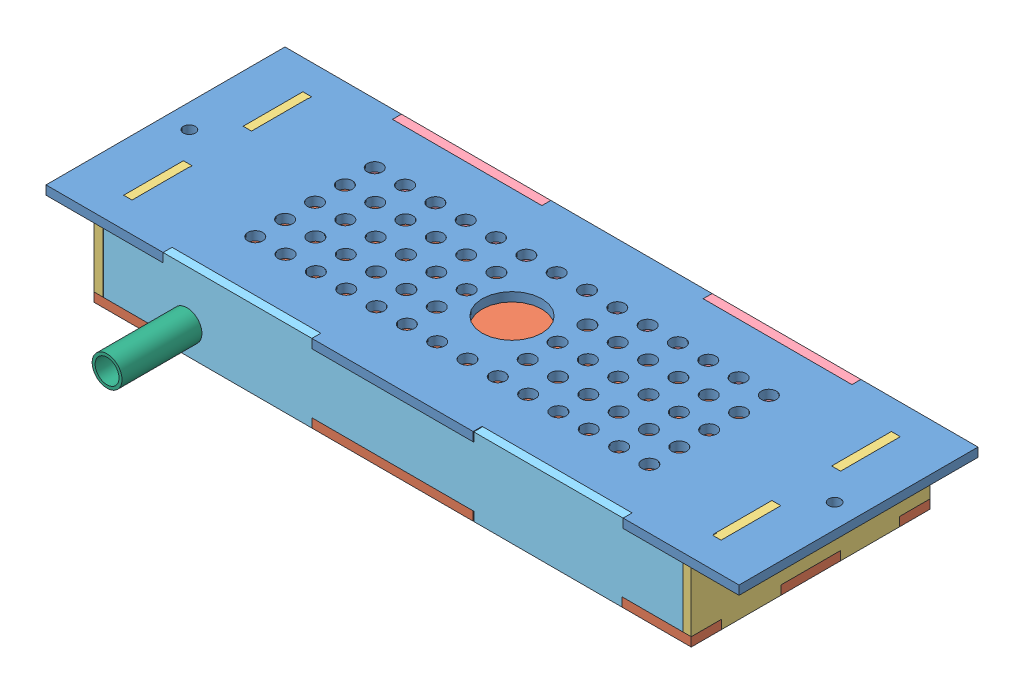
SolidWorks assembly stand.SLDASM, configuration Default (file format 9000). Lengths in mm.
Overall size (232 26 106.75).
7 component instances, 6 part files, 17 mates.
Components (placement in the parent):
- dispenser_stand-1: dispenser_stand.SLDPRT [Default] at (-170.7312 77.8011 232.5883) size (232 3 80)
- dispenser_stand.p2-1: dispenser_stand.p2.SLDPRT [Default] at (-154.7312 54.8011 232.5883) size (200 3 80)
- dispenser_stand.p3-1: dispenser_stand.p3.SLDPRT [Default] at (-154.7312 54.8011 312.5883) x (0 0 -1) z (1 0 0) size (80 26 3)
- dispenser_stand.p3-2: dispenser_stand.p3.SLDPRT [Default] at (42.2688 54.8011 312.5883) x (0 0 -1) z (1 0 0) size (80 26 3)
- dispenser_stand.p4-2: dispenser_stand.p4.SLDPRT [Default] at (-151.7312 54.8011 232.5883) size (194 26 3)
- dispenser_stand.p5-2: dispenser_stand.p5.SLDPRT [Default] at (42.4688 54.8011 312.5883) x (-1 0 0) z (0 0 -1) size (194 26 3)
- cylinder_dispenser-1: cylinder_dispenser.SLDPRT [Default] at (-123.5312 60.8011 309.3379) x (0.97573 0.218977 0) z (0 0 1) size (10 10 30)
Mates (geometry in assembly coordinates):
- Coincident7: coincident aligned: plane of dispenser_stand-1 through (-170.7312 77.8011 312.5883) normal (0 1 0); plane of dispenser_stand.p3-1 through (-151.7312 77.8011 242.5883) normal (0 1 0)
- Coincident8: coincident anti-aligned: plane of dispenser_stand-1 through (-154.7312 67.8011 242.5883) normal (1 0 0); plane of dispenser_stand.p3-1 through (-154.7312 54.8011 312.5883) normal (-1 0 0)
- Coincident9: coincident anti-aligned: plane of dispenser_stand-1 through (-154.7312 67.8011 302.5883) normal (0 0 -1); plane of dispenser_stand.p3-1 through (-151.7312 74.8011 302.5883) normal (0 0 1)
- Coincident10: coincident aligned: plane of dispenser_stand-1 through (-170.7312 77.8011 312.5883) normal (0 1 0); plane of dispenser_stand.p3-2 through (45.2688 77.8011 242.5883) normal (0 1 0)
- Coincident11: coincident anti-aligned: plane of dispenser_stand-1 through (45.2688 67.8011 302.5883) normal (0 0 -1); plane of dispenser_stand.p3-2 through (45.2688 74.8011 302.5883) normal (0 0 1)
- Coincident12: coincident anti-aligned: plane of dispenser_stand-1 through (45.2688 67.8011 302.5883) normal (-1 0 0); plane of dispenser_stand.p3-2 through (45.2688 54.8011 312.5883) normal (1 0 0)
- Coincident13: coincident aligned: plane of dispenser_stand.p2-1 through (45.2688 54.8011 312.5883) normal (1 0 0); plane of dispenser_stand.p3-2 through (45.2688 54.8011 312.5883) normal (1 0 0)
- Coincident14: coincident: plane of dispenser_stand.p2-1 through (-154.7312 54.8011 312.5883) normal (0 0 1); line of dispenser_stand.p3-2 through (42.2688 54.8011 312.5883) axis (0 1 0)
- Coincident15: coincident aligned: plane of dispenser_stand.p2-1 through (-154.7312 51.8011 312.5883) normal (0 -1 0); plane of dispenser_stand.p3-2 through (45.2688 51.8011 302.5883) normal (0 -1 0)
- Coincident19: coincident aligned: plane of dispenser_stand-1 through (-170.7312 77.8011 312.5883) normal (0 1 0); plane of dispenser_stand.p4-2 through (22.2688 77.8011 235.5883) normal (0 1 0)
- Coincident20: coincident aligned: plane of dispenser_stand-1 through (-170.7312 77.8011 232.5883) normal (0 0 -1); plane of dispenser_stand.p4-2 through (-151.7312 54.8011 232.5883) normal (0 0 -1)
- Coincident21: coincident anti-aligned: plane of dispenser_stand-1 through (-27.7312 74.8011 232.5883) normal (1 0 0); plane of dispenser_stand.p4-2 through (-27.7312 74.8011 235.5883) normal (-1 0 0)
- Coincident22: coincident aligned: plane of dispenser_stand-1 through (-170.7312 77.8011 312.5883) normal (0 1 0); plane of dispenser_stand.p5-2 through (-131.5312 77.8011 309.5883) normal (0 1 0)
- Coincident25: coincident aligned: plane of dispenser_stand-1 through (-170.7312 77.8011 312.5883) normal (0 1 0); plane of dispenser_stand.p5-2 through (-131.5312 77.8011 309.5883) normal (0 1 0)
- Coincident26: coincident anti-aligned: plane of dispenser_stand-1 through (-131.5312 74.8011 312.5883) normal (1 0 0); plane of dispenser_stand.p5-2 through (-131.5312 74.8011 309.5883) normal (-1 0 0)
- Coincident27: coincident aligned: plane of dispenser_stand-1 through (-170.7312 77.8011 312.5883) normal (0 0 1); plane of dispenser_stand.p5-2 through (42.4688 54.8011 312.5883) normal (0 0 1)
- Concentric2: concentric anti-aligned: cylinder of dispenser_stand.p5-2 through (-123.5312 60.8011 309.5883) axis (0 0 1) radius 5; cylinder of cylinder_dispenser-1 through (-123.5312 60.8011 339.3379) axis (0 0 -1) radius 5
